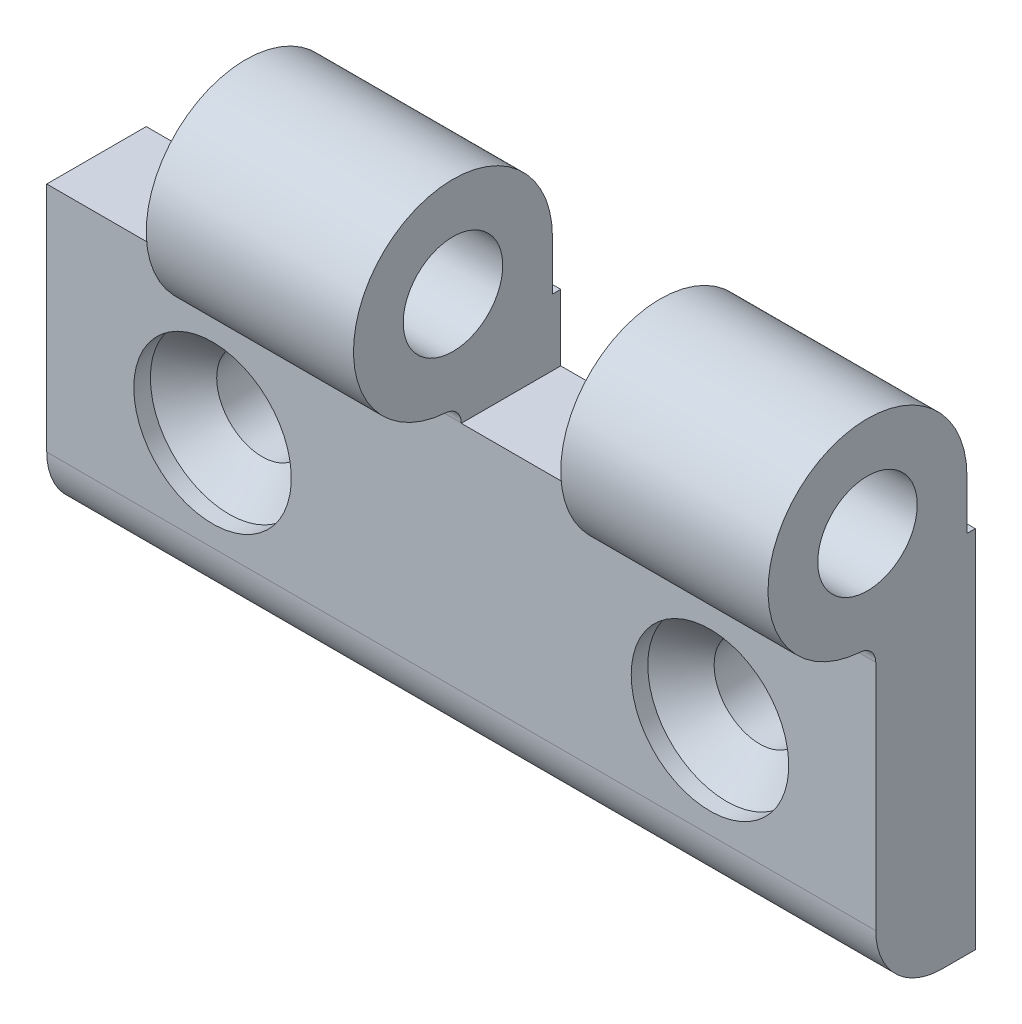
ISO-10303-21;
HEADER;
FILE_DESCRIPTION(('STEP AP214'),'2;1');
FILE_NAME('part.step','',(''),(''),'','','');
FILE_SCHEMA(('AUTOMOTIVE_DESIGN { 1 0 10303 214 1 1 1 1 }'));
ENDSEC;
DATA;
#1=APPLICATION_CONTEXT('core data for automotive mechanical design processes');
#2=APPLICATION_PROTOCOL_DEFINITION('international standard','automotive_design',2000,#1);
#3=PRODUCT_CONTEXT('',#1,'mechanical');
#4=PRODUCT('Part','Part','',(#3));
#5=PRODUCT_RELATED_PRODUCT_CATEGORY('part','',(#4));
#6=PRODUCT_DEFINITION_FORMATION('','',#4);
#7=PRODUCT_DEFINITION_CONTEXT('part definition',#1,'design');
#8=PRODUCT_DEFINITION('design','',#6,#7);
#9=PRODUCT_DEFINITION_SHAPE('','',#8);
#10=(LENGTH_UNIT() NAMED_UNIT(*) SI_UNIT(.MILLI.,.METRE.));
#11=(NAMED_UNIT(*) PLANE_ANGLE_UNIT() SI_UNIT($,.RADIAN.));
#12=(NAMED_UNIT(*) SI_UNIT($,.STERADIAN.) SOLID_ANGLE_UNIT());
#13=UNCERTAINTY_MEASURE_WITH_UNIT(LENGTH_MEASURE(1.E-05),#10,'distance_accuracy_value','');
#14=(GEOMETRIC_REPRESENTATION_CONTEXT(3) GLOBAL_UNCERTAINTY_ASSIGNED_CONTEXT((#13)) GLOBAL_UNIT_ASSIGNED_CONTEXT((#10,
#11,#12)) REPRESENTATION_CONTEXT('',''));
#15=CARTESIAN_POINT('',(0.,0.,0.));
#16=DIRECTION('',(0.,0.,1.));
#17=DIRECTION('',(1.,0.,0.));
#18=AXIS2_PLACEMENT_3D('',#15,#16,#17);
#19=CARTESIAN_POINT('',(30.,0.,5.5));
#20=DIRECTION('',(0.,0.,-1.));
#21=DIRECTION('',(-1.,0.,0.));
#22=AXIS2_PLACEMENT_3D('',#19,#20,#21);
#23=CYLINDRICAL_SURFACE('',#22,4.75);
#24=CARTESIAN_POINT('',(30.,0.,6.));
#25=DIRECTION('',(0.,0.,1.));
#26=DIRECTION('',(-1.,0.,0.));
#27=AXIS2_PLACEMENT_3D('',#24,#25,#26);
#28=CIRCLE('',#27,4.75);
#29=CARTESIAN_POINT('',(25.25,0.,6.));
#30=VERTEX_POINT('',#29);
#31=EDGE_CURVE('E153',#30,#30,#28,.T.);
#32=ORIENTED_EDGE('',*,*,#31,.T.);
#33=EDGE_LOOP('',(#32));
#34=FACE_BOUND('',#33,.T.);
#35=CARTESIAN_POINT('',(30.,0.,4.99999999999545));
#36=DIRECTION('',(0.,0.,-1.));
#37=DIRECTION('',(1.,0.,0.));
#38=AXIS2_PLACEMENT_3D('',#35,#36,#37);
#39=CIRCLE('',#38,4.74999999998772);
#40=CARTESIAN_POINT('',(34.7499999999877,0.,4.99999999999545));
#41=VERTEX_POINT('',#40);
#42=EDGE_CURVE('E256',#41,#41,#39,.F.);
#43=ORIENTED_EDGE('',*,*,#42,.F.);
#44=EDGE_LOOP('',(#43));
#45=FACE_BOUND('',#44,.T.);
#46=ADVANCED_FACE('F14',(#34,#45),#23,.F.);
#47=CARTESIAN_POINT('',(0.,0.,5.5));
#48=DIRECTION('',(0.,0.,-1.));
#49=DIRECTION('',(-1.,0.,0.));
#50=AXIS2_PLACEMENT_3D('',#47,#48,#49);
#51=CYLINDRICAL_SURFACE('',#50,4.75);
#52=CARTESIAN_POINT('',(0.,0.,6.));
#53=DIRECTION('',(0.,0.,1.));
#54=DIRECTION('',(-1.,0.,0.));
#55=AXIS2_PLACEMENT_3D('',#52,#53,#54);
#56=CIRCLE('',#55,4.75);
#57=CARTESIAN_POINT('',(-4.75,0.,6.));
#58=VERTEX_POINT('',#57);
#59=EDGE_CURVE('E157',#58,#58,#56,.T.);
#60=ORIENTED_EDGE('',*,*,#59,.T.);
#61=EDGE_LOOP('',(#60));
#62=FACE_BOUND('',#61,.T.);
#63=CARTESIAN_POINT('',(0.,0.,4.99999999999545));
#64=DIRECTION('',(0.,0.,-1.));
#65=DIRECTION('',(1.,0.,0.));
#66=AXIS2_PLACEMENT_3D('',#63,#64,#65);
#67=CIRCLE('',#66,4.74999999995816);
#68=CARTESIAN_POINT('',(4.74999999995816,0.,4.99999999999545));
#69=VERTEX_POINT('',#68);
#70=EDGE_CURVE('E225',#69,#69,#67,.F.);
#71=ORIENTED_EDGE('',*,*,#70,.F.);
#72=EDGE_LOOP('',(#71));
#73=FACE_BOUND('',#72,.T.);
#74=ADVANCED_FACE('F320',(#62,#73),#51,.F.);
#75=CARTESIAN_POINT('',(15.,8.01787997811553,7.));
#76=DIRECTION('',(1.,0.,0.));
#77=DIRECTION('',(0.,-1.,0.));
#78=AXIS2_PLACEMENT_3D('',#75,#76,#77);
#79=CYLINDRICAL_SURFACE('',#78,1.);
#80=DIRECTION('',(1.,0.,0.));
#81=VECTOR('',#80,1.);
#82=CARTESIAN_POINT('',(15.,9.0153256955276,6.92857142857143));
#83=LINE('',#82,#81);
#84=CARTESIAN_POINT('',(15.,9.0153256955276,6.92857142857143));
#85=VERTEX_POINT('',#84);
#86=CARTESIAN_POINT('',(2.5,9.0153256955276,6.92857142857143));
#87=VERTEX_POINT('',#86);
#88=EDGE_CURVE('E147',#85,#87,#83,.F.);
#89=ORIENTED_EDGE('',*,*,#88,.T.);
#90=CARTESIAN_POINT('',(2.5,8.01787997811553,7.));
#91=DIRECTION('',(-1.,0.,0.));
#92=DIRECTION('',(0.,-1.,0.));
#93=AXIS2_PLACEMENT_3D('',#90,#91,#92);
#94=CIRCLE('',#93,1.);
#95=CARTESIAN_POINT('',(2.5,8.01787997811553,6.));
#96=VERTEX_POINT('',#95);
#97=EDGE_CURVE('E149',#87,#96,#94,.T.);
#98=ORIENTED_EDGE('',*,*,#97,.T.);
#99=DIRECTION('',(1.,0.,0.));
#100=VECTOR('',#99,1.);
#101=CARTESIAN_POINT('',(-10.,8.01787997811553,6.));
#102=LINE('',#101,#100);
#103=CARTESIAN_POINT('',(15.,8.01787997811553,6.));
#104=VERTEX_POINT('',#103);
#105=EDGE_CURVE('E148',#96,#104,#102,.T.);
#106=ORIENTED_EDGE('',*,*,#105,.T.);
#107=CARTESIAN_POINT('',(15.,8.01787997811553,7.));
#108=DIRECTION('',(-1.,0.,0.));
#109=DIRECTION('',(0.,-1.,0.));
#110=AXIS2_PLACEMENT_3D('',#107,#108,#109);
#111=CIRCLE('',#110,1.);
#112=EDGE_CURVE('E17',#104,#85,#111,.F.);
#113=ORIENTED_EDGE('',*,*,#112,.T.);
#114=EDGE_LOOP('',(#89,#98,#106,#113));
#115=FACE_BOUND('',#114,.T.);
#116=ADVANCED_FACE('F145',(#115),#79,.F.);
#117=CARTESIAN_POINT('',(27.5,8.01787997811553,7.));
#118=DIRECTION('',(-1.,0.,0.));
#119=DIRECTION('',(0.,1.,0.));
#120=AXIS2_PLACEMENT_3D('',#117,#118,#119);
#121=CYLINDRICAL_SURFACE('',#120,1.);
#122=DIRECTION('',(1.,0.,0.));
#123=VECTOR('',#122,1.);
#124=CARTESIAN_POINT('',(-10.,8.01787997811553,6.));
#125=LINE('',#124,#123);
#126=CARTESIAN_POINT('',(27.5,8.01787997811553,6.));
#127=VERTEX_POINT('',#126);
#128=CARTESIAN_POINT('',(40.,8.01787997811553,6.));
#129=VERTEX_POINT('',#128);
#130=EDGE_CURVE('E216',#127,#129,#125,.T.);
#131=ORIENTED_EDGE('',*,*,#130,.T.);
#132=CARTESIAN_POINT('',(40.,8.01787997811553,7.));
#133=DIRECTION('',(1.,0.,0.));
#134=DIRECTION('',(0.,1.,0.));
#135=AXIS2_PLACEMENT_3D('',#132,#133,#134);
#136=CIRCLE('',#135,1.);
#137=CARTESIAN_POINT('',(40.,9.0153256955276,6.92857142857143));
#138=VERTEX_POINT('',#137);
#139=EDGE_CURVE('E259',#129,#138,#136,.T.);
#140=ORIENTED_EDGE('',*,*,#139,.T.);
#141=DIRECTION('',(-1.,0.,0.));
#142=VECTOR('',#141,1.);
#143=CARTESIAN_POINT('',(27.5,9.0153256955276,6.92857142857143));
#144=LINE('',#143,#142);
#145=CARTESIAN_POINT('',(27.5,9.0153256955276,6.92857142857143));
#146=VERTEX_POINT('',#145);
#147=EDGE_CURVE('E159',#138,#146,#144,.T.);
#148=ORIENTED_EDGE('',*,*,#147,.T.);
#149=CARTESIAN_POINT('',(27.5,8.01787997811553,7.));
#150=DIRECTION('',(1.,0.,0.));
#151=DIRECTION('',(0.,1.,0.));
#152=AXIS2_PLACEMENT_3D('',#149,#150,#151);
#153=CIRCLE('',#152,1.);
#154=EDGE_CURVE('E294',#146,#127,#153,.F.);
#155=ORIENTED_EDGE('',*,*,#154,.T.);
#156=EDGE_LOOP('',(#131,#140,#148,#155));
#157=FACE_BOUND('',#156,.T.);
#158=ADVANCED_FACE('F326',(#157),#121,.F.);
#159=CARTESIAN_POINT('',(30.,0.,4.99999999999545));
#160=DIRECTION('',(0.,0.,1.));
#161=DIRECTION('',(1.,0.,0.));
#162=AXIS2_PLACEMENT_3D('',#159,#160,#161);
#163=CONICAL_SURFACE('',#162,4.74999999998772,0.785398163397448);
#164=CARTESIAN_POINT('',(30.,0.,3.));
#165=DIRECTION('',(0.,0.,1.));
#166=DIRECTION('',(-1.,0.,0.));
#167=AXIS2_PLACEMENT_3D('',#164,#165,#166);
#168=CIRCLE('',#167,2.75);
#169=CARTESIAN_POINT('',(27.25,0.,3.));
#170=VERTEX_POINT('',#169);
#171=EDGE_CURVE('E251',#170,#170,#168,.T.);
#172=ORIENTED_EDGE('',*,*,#171,.F.);
#173=EDGE_LOOP('',(#172));
#174=FACE_BOUND('',#173,.T.);
#175=ORIENTED_EDGE('',*,*,#42,.T.);
#176=EDGE_LOOP('',(#175));
#177=FACE_BOUND('',#176,.T.);
#178=ADVANCED_FACE('F323',(#174,#177),#163,.F.);
#179=CARTESIAN_POINT('',(0.,0.,4.99999999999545));
#180=DIRECTION('',(0.,0.,1.));
#181=DIRECTION('',(1.,0.,0.));
#182=AXIS2_PLACEMENT_3D('',#179,#180,#181);
#183=CONICAL_SURFACE('',#182,4.74999999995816,0.785398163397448);
#184=CARTESIAN_POINT('',(0.,0.,3.));
#185=DIRECTION('',(0.,0.,1.));
#186=DIRECTION('',(-1.,0.,0.));
#187=AXIS2_PLACEMENT_3D('',#184,#185,#186);
#188=CIRCLE('',#187,2.75);
#189=CARTESIAN_POINT('',(-2.75,0.,3.));
#190=VERTEX_POINT('',#189);
#191=EDGE_CURVE('E247',#190,#190,#188,.T.);
#192=ORIENTED_EDGE('',*,*,#191,.F.);
#193=EDGE_LOOP('',(#192));
#194=FACE_BOUND('',#193,.T.);
#195=ORIENTED_EDGE('',*,*,#70,.T.);
#196=EDGE_LOOP('',(#195));
#197=FACE_BOUND('',#196,.T.);
#198=ADVANCED_FACE('F325',(#194,#197),#183,.F.);
#199=CARTESIAN_POINT('',(27.5,15.,6.5));
#200=DIRECTION('',(-1.,0.,0.));
#201=DIRECTION('',(0.,1.,0.));
#202=AXIS2_PLACEMENT_3D('',#199,#200,#201);
#203=CYLINDRICAL_SURFACE('',#202,3.);
#204=CARTESIAN_POINT('',(40.,15.,6.5));
#205=DIRECTION('',(1.,0.,0.));
#206=DIRECTION('',(0.,1.,0.));
#207=AXIS2_PLACEMENT_3D('',#204,#205,#206);
#208=CIRCLE('',#207,3.);
#209=CARTESIAN_POINT('',(40.,18.,6.5));
#210=VERTEX_POINT('',#209);
#211=EDGE_CURVE('E250',#210,#210,#208,.F.);
#212=ORIENTED_EDGE('',*,*,#211,.F.);
#213=EDGE_LOOP('',(#212));
#214=FACE_BOUND('',#213,.T.);
#215=CARTESIAN_POINT('',(27.5,15.,6.5));
#216=DIRECTION('',(1.,0.,0.));
#217=DIRECTION('',(0.,1.,0.));
#218=AXIS2_PLACEMENT_3D('',#215,#216,#217);
#219=CIRCLE('',#218,3.);
#220=CARTESIAN_POINT('',(27.5,18.,6.5));
#221=VERTEX_POINT('',#220);
#222=EDGE_CURVE('E229',#221,#221,#219,.F.);
#223=ORIENTED_EDGE('',*,*,#222,.T.);
#224=EDGE_LOOP('',(#223));
#225=FACE_BOUND('',#224,.T.);
#226=ADVANCED_FACE('F335',(#214,#225),#203,.F.);
#227=CARTESIAN_POINT('',(27.5,12.,0.5));
#228=DIRECTION('',(0.,0.,-1.));
#229=DIRECTION('',(-1.,0.,0.));
#230=AXIS2_PLACEMENT_3D('',#227,#228,#229);
#231=PLANE('',#230);
#232=DIRECTION('',(0.,1.,0.));
#233=VECTOR('',#232,1.);
#234=CARTESIAN_POINT('',(27.5,15.,0.5));
#235=LINE('',#234,#233);
#236=CARTESIAN_POINT('',(27.5,12.,0.5));
#237=VERTEX_POINT('',#236);
#238=CARTESIAN_POINT('',(27.5,15.,0.5));
#239=VERTEX_POINT('',#238);
#240=EDGE_CURVE('E228',#237,#239,#235,.T.);
#241=ORIENTED_EDGE('',*,*,#240,.T.);
#242=DIRECTION('',(-1.,0.,0.));
#243=VECTOR('',#242,1.);
#244=CARTESIAN_POINT('',(27.5,15.,0.5));
#245=LINE('',#244,#243);
#246=CARTESIAN_POINT('',(40.,15.,0.5));
#247=VERTEX_POINT('',#246);
#248=EDGE_CURVE('E222',#239,#247,#245,.F.);
#249=ORIENTED_EDGE('',*,*,#248,.T.);
#250=DIRECTION('',(0.,1.,0.));
#251=VECTOR('',#250,1.);
#252=CARTESIAN_POINT('',(40.,15.,0.5));
#253=LINE('',#252,#251);
#254=CARTESIAN_POINT('',(40.,12.,0.5));
#255=VERTEX_POINT('',#254);
#256=EDGE_CURVE('E287',#255,#247,#253,.T.);
#257=ORIENTED_EDGE('',*,*,#256,.F.);
#258=DIRECTION('',(1.,0.,0.));
#259=VECTOR('',#258,1.);
#260=CARTESIAN_POINT('',(27.5,12.,0.5));
#261=LINE('',#260,#259);
#262=EDGE_CURVE('E232',#255,#237,#261,.F.);
#263=ORIENTED_EDGE('',*,*,#262,.T.);
#264=EDGE_LOOP('',(#241,#249,#257,#263));
#265=FACE_BOUND('',#264,.T.);
#266=ADVANCED_FACE('F550',(#265),#231,.T.);
#267=CARTESIAN_POINT('',(27.5,15.,6.5));
#268=DIRECTION('',(-1.,0.,0.));
#269=DIRECTION('',(0.,1.,0.));
#270=AXIS2_PLACEMENT_3D('',#267,#268,#269);
#271=CYLINDRICAL_SURFACE('',#270,6.);
#272=ORIENTED_EDGE('',*,*,#147,.F.);
#273=CARTESIAN_POINT('',(40.,15.,6.5));
#274=DIRECTION('',(1.,0.,0.));
#275=DIRECTION('',(0.,1.,0.));
#276=AXIS2_PLACEMENT_3D('',#273,#274,#275);
#277=CIRCLE('',#276,6.);
#278=EDGE_CURVE('E285',#247,#138,#277,.T.);
#279=ORIENTED_EDGE('',*,*,#278,.F.);
#280=ORIENTED_EDGE('',*,*,#248,.F.);
#281=CARTESIAN_POINT('',(27.5,15.,6.5));
#282=DIRECTION('',(1.,0.,0.));
#283=DIRECTION('',(0.,1.,0.));
#284=AXIS2_PLACEMENT_3D('',#281,#282,#283);
#285=CIRCLE('',#284,6.);
#286=EDGE_CURVE('E278',#239,#146,#285,.T.);
#287=ORIENTED_EDGE('',*,*,#286,.T.);
#288=EDGE_LOOP('',(#272,#279,#280,#287));
#289=FACE_BOUND('',#288,.T.);
#290=ADVANCED_FACE('F546',(#289),#271,.T.);
#291=CARTESIAN_POINT('',(15.,15.,6.5));
#292=DIRECTION('',(1.,0.,0.));
#293=DIRECTION('',(0.,-1.,0.));
#294=AXIS2_PLACEMENT_3D('',#291,#292,#293);
#295=CYLINDRICAL_SURFACE('',#294,3.);
#296=CARTESIAN_POINT('',(15.,15.,6.5));
#297=DIRECTION('',(-1.,0.,0.));
#298=DIRECTION('',(0.,-1.,0.));
#299=AXIS2_PLACEMENT_3D('',#296,#297,#298);
#300=CIRCLE('',#299,3.);
#301=CARTESIAN_POINT('',(15.,12.,6.5));
#302=VERTEX_POINT('',#301);
#303=EDGE_CURVE('E184',#302,#302,#300,.T.);
#304=ORIENTED_EDGE('',*,*,#303,.F.);
#305=EDGE_LOOP('',(#304));
#306=FACE_BOUND('',#305,.T.);
#307=CARTESIAN_POINT('',(2.5,15.,6.5));
#308=DIRECTION('',(-1.,0.,0.));
#309=DIRECTION('',(0.,-1.,0.));
#310=AXIS2_PLACEMENT_3D('',#307,#308,#309);
#311=CIRCLE('',#310,3.);
#312=CARTESIAN_POINT('',(2.5,12.,6.5));
#313=VERTEX_POINT('',#312);
#314=EDGE_CURVE('E167',#313,#313,#311,.T.);
#315=ORIENTED_EDGE('',*,*,#314,.T.);
#316=EDGE_LOOP('',(#315));
#317=FACE_BOUND('',#316,.T.);
#318=ADVANCED_FACE('F542',(#306,#317),#295,.F.);
#319=CARTESIAN_POINT('',(15.,15.,0.5));
#320=DIRECTION('',(0.,0.,-1.));
#321=DIRECTION('',(-1.,0.,0.));
#322=AXIS2_PLACEMENT_3D('',#319,#320,#321);
#323=PLANE('',#322);
#324=DIRECTION('',(0.,1.,0.));
#325=VECTOR('',#324,1.);
#326=CARTESIAN_POINT('',(15.,15.,0.5));
#327=LINE('',#326,#325);
#328=CARTESIAN_POINT('',(15.,12.,0.5));
#329=VERTEX_POINT('',#328);
#330=CARTESIAN_POINT('',(15.,15.,0.5));
#331=VERTEX_POINT('',#330);
#332=EDGE_CURVE('E137',#329,#331,#327,.T.);
#333=ORIENTED_EDGE('',*,*,#332,.F.);
#334=DIRECTION('',(1.,0.,0.));
#335=VECTOR('',#334,1.);
#336=CARTESIAN_POINT('',(15.,12.,0.5));
#337=LINE('',#336,#335);
#338=CARTESIAN_POINT('',(2.5,12.,0.5));
#339=VERTEX_POINT('',#338);
#340=EDGE_CURVE('E170',#329,#339,#337,.F.);
#341=ORIENTED_EDGE('',*,*,#340,.T.);
#342=DIRECTION('',(0.,1.,0.));
#343=VECTOR('',#342,1.);
#344=CARTESIAN_POINT('',(2.5,15.,0.5));
#345=LINE('',#344,#343);
#346=CARTESIAN_POINT('',(2.5,15.,0.5));
#347=VERTEX_POINT('',#346);
#348=EDGE_CURVE('E166',#339,#347,#345,.T.);
#349=ORIENTED_EDGE('',*,*,#348,.T.);
#350=DIRECTION('',(1.,0.,0.));
#351=VECTOR('',#350,1.);
#352=CARTESIAN_POINT('',(15.,15.,0.5));
#353=LINE('',#352,#351);
#354=EDGE_CURVE('E154',#347,#331,#353,.T.);
#355=ORIENTED_EDGE('',*,*,#354,.T.);
#356=EDGE_LOOP('',(#333,#341,#349,#355));
#357=FACE_BOUND('',#356,.T.);
#358=ADVANCED_FACE('F540',(#357),#323,.T.);
#359=CARTESIAN_POINT('',(15.,15.,6.5));
#360=DIRECTION('',(1.,0.,0.));
#361=DIRECTION('',(0.,-1.,0.));
#362=AXIS2_PLACEMENT_3D('',#359,#360,#361);
#363=CYLINDRICAL_SURFACE('',#362,6.);
#364=ORIENTED_EDGE('',*,*,#88,.F.);
#365=CARTESIAN_POINT('',(15.,15.,6.5));
#366=DIRECTION('',(-1.,0.,0.));
#367=DIRECTION('',(0.,-1.,0.));
#368=AXIS2_PLACEMENT_3D('',#365,#366,#367);
#369=CIRCLE('',#368,6.);
#370=EDGE_CURVE('E132',#331,#85,#369,.F.);
#371=ORIENTED_EDGE('',*,*,#370,.F.);
#372=ORIENTED_EDGE('',*,*,#354,.F.);
#373=CARTESIAN_POINT('',(2.5,15.,6.5));
#374=DIRECTION('',(-1.,0.,0.));
#375=DIRECTION('',(0.,-1.,0.));
#376=AXIS2_PLACEMENT_3D('',#373,#374,#375);
#377=CIRCLE('',#376,6.);
#378=EDGE_CURVE('E151',#347,#87,#377,.F.);
#379=ORIENTED_EDGE('',*,*,#378,.T.);
#380=EDGE_LOOP('',(#364,#371,#372,#379));
#381=FACE_BOUND('',#380,.T.);
#382=ADVANCED_FACE('F150',(#381),#363,.T.);
#383=CARTESIAN_POINT('',(-10.,8.,6.));
#384=DIRECTION('',(0.,0.,1.));
#385=DIRECTION('',(1.,0.,0.));
#386=AXIS2_PLACEMENT_3D('',#383,#384,#385);
#387=PLANE('',#386);
#388=DIRECTION('',(0.,1.,0.));
#389=VECTOR('',#388,1.);
#390=CARTESIAN_POINT('',(27.5,15.,6.));
#391=LINE('',#390,#389);
#392=CARTESIAN_POINT('',(27.5,8.,6.));
#393=VERTEX_POINT('',#392);
#394=EDGE_CURVE('E203',#127,#393,#391,.F.);
#395=ORIENTED_EDGE('',*,*,#394,.T.);
#396=DIRECTION('',(1.,0.,0.));
#397=VECTOR('',#396,1.);
#398=CARTESIAN_POINT('',(-10.,8.,6.));
#399=LINE('',#398,#397);
#400=CARTESIAN_POINT('',(15.,8.,6.));
#401=VERTEX_POINT('',#400);
#402=EDGE_CURVE('E192',#393,#401,#399,.F.);
#403=ORIENTED_EDGE('',*,*,#402,.T.);
#404=DIRECTION('',(0.,1.,0.));
#405=VECTOR('',#404,1.);
#406=CARTESIAN_POINT('',(15.,15.,6.));
#407=LINE('',#406,#405);
#408=EDGE_CURVE('E127',#104,#401,#407,.F.);
#409=ORIENTED_EDGE('',*,*,#408,.F.);
#410=ORIENTED_EDGE('',*,*,#105,.F.);
#411=DIRECTION('',(0.,1.,0.));
#412=VECTOR('',#411,1.);
#413=CARTESIAN_POINT('',(2.5,15.,6.));
#414=LINE('',#413,#412);
#415=CARTESIAN_POINT('',(2.5,8.,6.));
#416=VERTEX_POINT('',#415);
#417=EDGE_CURVE('E273',#96,#416,#414,.F.);
#418=ORIENTED_EDGE('',*,*,#417,.T.);
#419=DIRECTION('',(1.,0.,0.));
#420=VECTOR('',#419,1.);
#421=CARTESIAN_POINT('',(-10.,8.,6.));
#422=LINE('',#421,#420);
#423=CARTESIAN_POINT('',(-10.,8.,6.));
#424=VERTEX_POINT('',#423);
#425=EDGE_CURVE('E634',#416,#424,#422,.F.);
#426=ORIENTED_EDGE('',*,*,#425,.T.);
#427=DIRECTION('',(0.,1.,0.));
#428=VECTOR('',#427,1.);
#429=CARTESIAN_POINT('',(-10.,15.,6.));
#430=LINE('',#429,#428);
#431=CARTESIAN_POINT('',(-10.,-6.,6.));
#432=VERTEX_POINT('',#431);
#433=EDGE_CURVE('E271',#424,#432,#430,.F.);
#434=ORIENTED_EDGE('',*,*,#433,.T.);
#435=DIRECTION('',(-1.,0.,0.));
#436=VECTOR('',#435,1.);
#437=CARTESIAN_POINT('',(-10.,-6.,6.));
#438=LINE('',#437,#436);
#439=CARTESIAN_POINT('',(40.,-6.,6.));
#440=VERTEX_POINT('',#439);
#441=EDGE_CURVE('E219',#432,#440,#438,.F.);
#442=ORIENTED_EDGE('',*,*,#441,.T.);
#443=DIRECTION('',(0.,1.,0.));
#444=VECTOR('',#443,1.);
#445=CARTESIAN_POINT('',(40.,15.,6.));
#446=LINE('',#445,#444);
#447=EDGE_CURVE('E284',#129,#440,#446,.F.);
#448=ORIENTED_EDGE('',*,*,#447,.F.);
#449=ORIENTED_EDGE('',*,*,#130,.F.);
#450=EDGE_LOOP('',(#395,#403,#409,#410,#418,#426,#434,#442,#448,#449));
#451=FACE_BOUND('',#450,.T.);
#452=ORIENTED_EDGE('',*,*,#59,.F.);
#453=EDGE_LOOP('',(#452));
#454=FACE_BOUND('',#453,.T.);
#455=ORIENTED_EDGE('',*,*,#31,.F.);
#456=EDGE_LOOP('',(#455));
#457=FACE_BOUND('',#456,.T.);
#458=ADVANCED_FACE('F308',(#451,#454,#457),#387,.T.);
#459=CARTESIAN_POINT('',(-10.,-6.,2.));
#460=DIRECTION('',(-1.,0.,0.));
#461=DIRECTION('',(0.,1.,0.));
#462=AXIS2_PLACEMENT_3D('',#459,#460,#461);
#463=CYLINDRICAL_SURFACE('',#462,4.);
#464=CARTESIAN_POINT('',(-10.,-6.,2.));
#465=DIRECTION('',(1.,0.,0.));
#466=DIRECTION('',(0.,1.,0.));
#467=AXIS2_PLACEMENT_3D('',#464,#465,#466);
#468=CIRCLE('',#467,4.);
#469=CARTESIAN_POINT('',(-10.,-10.,2.));
#470=VERTEX_POINT('',#469);
#471=EDGE_CURVE('E267',#432,#470,#468,.T.);
#472=ORIENTED_EDGE('',*,*,#471,.T.);
#473=DIRECTION('',(-1.,0.,0.));
#474=VECTOR('',#473,1.);
#475=CARTESIAN_POINT('',(-10.,-10.,2.));
#476=LINE('',#475,#474);
#477=CARTESIAN_POINT('',(40.,-10.,2.));
#478=VERTEX_POINT('',#477);
#479=EDGE_CURVE('E266',#470,#478,#476,.F.);
#480=ORIENTED_EDGE('',*,*,#479,.T.);
#481=CARTESIAN_POINT('',(40.,-6.,2.));
#482=DIRECTION('',(1.,0.,0.));
#483=DIRECTION('',(0.,1.,0.));
#484=AXIS2_PLACEMENT_3D('',#481,#482,#483);
#485=CIRCLE('',#484,4.);
#486=EDGE_CURVE('E244',#440,#478,#485,.T.);
#487=ORIENTED_EDGE('',*,*,#486,.F.);
#488=ORIENTED_EDGE('',*,*,#441,.F.);
#489=EDGE_LOOP('',(#472,#480,#487,#488));
#490=FACE_BOUND('',#489,.T.);
#491=ADVANCED_FACE('F312',(#490),#463,.T.);
#492=CARTESIAN_POINT('',(30.,0.,1.5));
#493=DIRECTION('',(0.,0.,-1.));
#494=DIRECTION('',(-1.,0.,0.));
#495=AXIS2_PLACEMENT_3D('',#492,#493,#494);
#496=CYLINDRICAL_SURFACE('',#495,2.75);
#497=CARTESIAN_POINT('',(30.,0.,0.));
#498=DIRECTION('',(0.,0.,1.));
#499=DIRECTION('',(-1.,0.,0.));
#500=AXIS2_PLACEMENT_3D('',#497,#498,#499);
#501=CIRCLE('',#500,2.75);
#502=CARTESIAN_POINT('',(27.25,0.,0.));
#503=VERTEX_POINT('',#502);
#504=EDGE_CURVE('E263',#503,#503,#501,.F.);
#505=ORIENTED_EDGE('',*,*,#504,.T.);
#506=EDGE_LOOP('',(#505));
#507=FACE_BOUND('',#506,.T.);
#508=ORIENTED_EDGE('',*,*,#171,.T.);
#509=EDGE_LOOP('',(#508));
#510=FACE_BOUND('',#509,.T.);
#511=ADVANCED_FACE('F407',(#507,#510),#496,.F.);
#512=CARTESIAN_POINT('',(0.,0.,1.5));
#513=DIRECTION('',(0.,0.,-1.));
#514=DIRECTION('',(-1.,0.,0.));
#515=AXIS2_PLACEMENT_3D('',#512,#513,#514);
#516=CYLINDRICAL_SURFACE('',#515,2.75);
#517=CARTESIAN_POINT('',(0.,0.,0.));
#518=DIRECTION('',(0.,0.,1.));
#519=DIRECTION('',(-1.,0.,0.));
#520=AXIS2_PLACEMENT_3D('',#517,#518,#519);
#521=CIRCLE('',#520,2.75);
#522=CARTESIAN_POINT('',(-2.75,0.,0.));
#523=VERTEX_POINT('',#522);
#524=EDGE_CURVE('E260',#523,#523,#521,.F.);
#525=ORIENTED_EDGE('',*,*,#524,.T.);
#526=EDGE_LOOP('',(#525));
#527=FACE_BOUND('',#526,.T.);
#528=ORIENTED_EDGE('',*,*,#191,.T.);
#529=EDGE_LOOP('',(#528));
#530=FACE_BOUND('',#529,.T.);
#531=ADVANCED_FACE('F415',(#527,#530),#516,.F.);
#532=CARTESIAN_POINT('',(40.,15.,0.));
#533=DIRECTION('',(-1.,0.,0.));
#534=DIRECTION('',(0.,1.,0.));
#535=AXIS2_PLACEMENT_3D('',#532,#533,#534);
#536=PLANE('',#535);
#537=DIRECTION('',(0.,0.,1.));
#538=VECTOR('',#537,1.);
#539=CARTESIAN_POINT('',(40.,-10.,2.));
#540=LINE('',#539,#538);
#541=CARTESIAN_POINT('',(40.,-10.,0.));
#542=VERTEX_POINT('',#541);
#543=EDGE_CURVE('E270',#478,#542,#540,.F.);
#544=ORIENTED_EDGE('',*,*,#543,.T.);
#545=DIRECTION('',(0.,-1.,0.));
#546=VECTOR('',#545,1.);
#547=CARTESIAN_POINT('',(40.,-10.,0.));
#548=LINE('',#547,#546);
#549=CARTESIAN_POINT('',(40.,12.,0.));
#550=VERTEX_POINT('',#549);
#551=EDGE_CURVE('E240',#542,#550,#548,.F.);
#552=ORIENTED_EDGE('',*,*,#551,.T.);
#553=DIRECTION('',(0.,0.,1.));
#554=VECTOR('',#553,1.);
#555=CARTESIAN_POINT('',(40.,12.,0.));
#556=LINE('',#555,#554);
#557=EDGE_CURVE('E235',#550,#255,#556,.T.);
#558=ORIENTED_EDGE('',*,*,#557,.T.);
#559=ORIENTED_EDGE('',*,*,#256,.T.);
#560=ORIENTED_EDGE('',*,*,#278,.T.);
#561=ORIENTED_EDGE('',*,*,#139,.F.);
#562=ORIENTED_EDGE('',*,*,#447,.T.);
#563=ORIENTED_EDGE('',*,*,#486,.T.);
#564=EDGE_LOOP('',(#544,#552,#558,#559,#560,#561,#562,#563));
#565=FACE_BOUND('',#564,.T.);
#566=ORIENTED_EDGE('',*,*,#211,.T.);
#567=EDGE_LOOP('',(#566));
#568=FACE_BOUND('',#567,.T.);
#569=ADVANCED_FACE('F424',(#565,#568),#536,.F.);
#570=CARTESIAN_POINT('',(27.5,12.,0.));
#571=DIRECTION('',(0.,1.,0.));
#572=DIRECTION('',(1.,0.,0.));
#573=AXIS2_PLACEMENT_3D('',#570,#571,#572);
#574=PLANE('',#573);
#575=DIRECTION('',(0.,0.,1.));
#576=VECTOR('',#575,1.);
#577=CARTESIAN_POINT('',(27.5,12.,0.));
#578=LINE('',#577,#576);
#579=CARTESIAN_POINT('',(27.5,12.,0.));
#580=VERTEX_POINT('',#579);
#581=EDGE_CURVE('E226',#580,#237,#578,.T.);
#582=ORIENTED_EDGE('',*,*,#581,.T.);
#583=ORIENTED_EDGE('',*,*,#262,.F.);
#584=ORIENTED_EDGE('',*,*,#557,.F.);
#585=DIRECTION('',(-1.,0.,0.));
#586=VECTOR('',#585,1.);
#587=CARTESIAN_POINT('',(-10.,12.,0.));
#588=LINE('',#587,#586);
#589=EDGE_CURVE('E213',#550,#580,#588,.T.);
#590=ORIENTED_EDGE('',*,*,#589,.T.);
#591=EDGE_LOOP('',(#582,#583,#584,#590));
#592=FACE_BOUND('',#591,.T.);
#593=ADVANCED_FACE('F433',(#592),#574,.T.);
#594=CARTESIAN_POINT('',(27.5,15.,0.));
#595=DIRECTION('',(-1.,0.,0.));
#596=DIRECTION('',(0.,1.,0.));
#597=AXIS2_PLACEMENT_3D('',#594,#595,#596);
#598=PLANE('',#597);
#599=ORIENTED_EDGE('',*,*,#154,.F.);
#600=ORIENTED_EDGE('',*,*,#286,.F.);
#601=ORIENTED_EDGE('',*,*,#240,.F.);
#602=ORIENTED_EDGE('',*,*,#581,.F.);
#603=DIRECTION('',(0.,-1.,0.));
#604=VECTOR('',#603,1.);
#605=CARTESIAN_POINT('',(27.5,-10.,0.));
#606=LINE('',#605,#604);
#607=CARTESIAN_POINT('',(27.5,8.,0.));
#608=VERTEX_POINT('',#607);
#609=EDGE_CURVE('E208',#580,#608,#606,.T.);
#610=ORIENTED_EDGE('',*,*,#609,.T.);
#611=DIRECTION('',(0.,0.,1.));
#612=VECTOR('',#611,1.);
#613=CARTESIAN_POINT('',(27.5,8.,0.));
#614=LINE('',#613,#612);
#615=EDGE_CURVE('E194',#608,#393,#614,.T.);
#616=ORIENTED_EDGE('',*,*,#615,.T.);
#617=ORIENTED_EDGE('',*,*,#394,.F.);
#618=EDGE_LOOP('',(#599,#600,#601,#602,#610,#616,#617));
#619=FACE_BOUND('',#618,.T.);
#620=ORIENTED_EDGE('',*,*,#222,.F.);
#621=EDGE_LOOP('',(#620));
#622=FACE_BOUND('',#621,.T.);
#623=ADVANCED_FACE('F442',(#619,#622),#598,.T.);
#624=CARTESIAN_POINT('',(-10.,8.,0.));
#625=DIRECTION('',(0.,1.,0.));
#626=DIRECTION('',(1.,0.,0.));
#627=AXIS2_PLACEMENT_3D('',#624,#625,#626);
#628=PLANE('',#627);
#629=DIRECTION('',(0.,0.,1.));
#630=VECTOR('',#629,1.);
#631=CARTESIAN_POINT('',(15.,8.,0.));
#632=LINE('',#631,#630);
#633=CARTESIAN_POINT('',(15.,8.,0.));
#634=VERTEX_POINT('',#633);
#635=EDGE_CURVE('E197',#401,#634,#632,.F.);
#636=ORIENTED_EDGE('',*,*,#635,.F.);
#637=ORIENTED_EDGE('',*,*,#402,.F.);
#638=ORIENTED_EDGE('',*,*,#615,.F.);
#639=DIRECTION('',(-1.,0.,0.));
#640=VECTOR('',#639,1.);
#641=CARTESIAN_POINT('',(-10.,8.,0.));
#642=LINE('',#641,#640);
#643=EDGE_CURVE('E189',#608,#634,#642,.T.);
#644=ORIENTED_EDGE('',*,*,#643,.T.);
#645=EDGE_LOOP('',(#636,#637,#638,#644));
#646=FACE_BOUND('',#645,.T.);
#647=ADVANCED_FACE('F451',(#646),#628,.T.);
#648=CARTESIAN_POINT('',(15.,15.,0.));
#649=DIRECTION('',(-1.,0.,0.));
#650=DIRECTION('',(0.,1.,0.));
#651=AXIS2_PLACEMENT_3D('',#648,#649,#650);
#652=PLANE('',#651);
#653=ORIENTED_EDGE('',*,*,#303,.T.);
#654=EDGE_LOOP('',(#653));
#655=FACE_BOUND('',#654,.T.);
#656=ORIENTED_EDGE('',*,*,#408,.T.);
#657=ORIENTED_EDGE('',*,*,#635,.T.);
#658=DIRECTION('',(0.,-1.,0.));
#659=VECTOR('',#658,1.);
#660=CARTESIAN_POINT('',(15.,-10.,0.));
#661=LINE('',#660,#659);
#662=CARTESIAN_POINT('',(15.,12.,0.));
#663=VERTEX_POINT('',#662);
#664=EDGE_CURVE('E180',#634,#663,#661,.F.);
#665=ORIENTED_EDGE('',*,*,#664,.T.);
#666=DIRECTION('',(0.,0.,1.));
#667=VECTOR('',#666,1.);
#668=CARTESIAN_POINT('',(15.,12.,0.5));
#669=LINE('',#668,#667);
#670=EDGE_CURVE('E173',#663,#329,#669,.T.);
#671=ORIENTED_EDGE('',*,*,#670,.T.);
#672=ORIENTED_EDGE('',*,*,#332,.T.);
#673=ORIENTED_EDGE('',*,*,#370,.T.);
#674=ORIENTED_EDGE('',*,*,#112,.F.);
#675=EDGE_LOOP('',(#656,#657,#665,#671,#672,#673,#674));
#676=FACE_BOUND('',#675,.T.);
#677=ADVANCED_FACE('F134',(#655,#676),#652,.F.);
#678=CARTESIAN_POINT('',(15.,12.,0.5));
#679=DIRECTION('',(0.,1.,0.));
#680=DIRECTION('',(1.,0.,0.));
#681=AXIS2_PLACEMENT_3D('',#678,#679,#680);
#682=PLANE('',#681);
#683=ORIENTED_EDGE('',*,*,#670,.F.);
#684=DIRECTION('',(-1.,0.,0.));
#685=VECTOR('',#684,1.);
#686=CARTESIAN_POINT('',(-10.,12.,0.));
#687=LINE('',#686,#685);
#688=CARTESIAN_POINT('',(2.5,12.,0.));
#689=VERTEX_POINT('',#688);
#690=EDGE_CURVE('E176',#663,#689,#687,.T.);
#691=ORIENTED_EDGE('',*,*,#690,.T.);
#692=DIRECTION('',(0.,0.,1.));
#693=VECTOR('',#692,1.);
#694=CARTESIAN_POINT('',(2.5,12.,0.));
#695=LINE('',#694,#693);
#696=EDGE_CURVE('E164',#689,#339,#695,.T.);
#697=ORIENTED_EDGE('',*,*,#696,.T.);
#698=ORIENTED_EDGE('',*,*,#340,.F.);
#699=EDGE_LOOP('',(#683,#691,#697,#698));
#700=FACE_BOUND('',#699,.T.);
#701=ADVANCED_FACE('F468',(#700),#682,.T.);
#702=CARTESIAN_POINT('',(2.5,15.,0.));
#703=DIRECTION('',(-1.,0.,0.));
#704=DIRECTION('',(0.,1.,0.));
#705=AXIS2_PLACEMENT_3D('',#702,#703,#704);
#706=PLANE('',#705);
#707=ORIENTED_EDGE('',*,*,#97,.F.);
#708=ORIENTED_EDGE('',*,*,#378,.F.);
#709=ORIENTED_EDGE('',*,*,#348,.F.);
#710=ORIENTED_EDGE('',*,*,#696,.F.);
#711=DIRECTION('',(0.,-1.,0.));
#712=VECTOR('',#711,1.);
#713=CARTESIAN_POINT('',(2.5,-10.,0.));
#714=LINE('',#713,#712);
#715=CARTESIAN_POINT('',(2.5,8.,0.));
#716=VERTEX_POINT('',#715);
#717=EDGE_CURVE('E179',#689,#716,#714,.T.);
#718=ORIENTED_EDGE('',*,*,#717,.T.);
#719=DIRECTION('',(0.,0.,1.));
#720=VECTOR('',#719,1.);
#721=CARTESIAN_POINT('',(2.5,8.,0.));
#722=LINE('',#721,#720);
#723=EDGE_CURVE('E303',#716,#416,#722,.T.);
#724=ORIENTED_EDGE('',*,*,#723,.T.);
#725=ORIENTED_EDGE('',*,*,#417,.F.);
#726=EDGE_LOOP('',(#707,#708,#709,#710,#718,#724,#725));
#727=FACE_BOUND('',#726,.T.);
#728=ORIENTED_EDGE('',*,*,#314,.F.);
#729=EDGE_LOOP('',(#728));
#730=FACE_BOUND('',#729,.T.);
#731=ADVANCED_FACE('F297',(#727,#730),#706,.T.);
#732=CARTESIAN_POINT('',(-10.,8.,0.));
#733=DIRECTION('',(0.,1.,0.));
#734=DIRECTION('',(1.,0.,0.));
#735=AXIS2_PLACEMENT_3D('',#732,#733,#734);
#736=PLANE('',#735);
#737=DIRECTION('',(0.,0.,1.));
#738=VECTOR('',#737,1.);
#739=CARTESIAN_POINT('',(-10.,8.,0.));
#740=LINE('',#739,#738);
#741=CARTESIAN_POINT('',(-10.,8.,0.));
#742=VERTEX_POINT('',#741);
#743=EDGE_CURVE('E632',#742,#424,#740,.T.);
#744=ORIENTED_EDGE('',*,*,#743,.T.);
#745=ORIENTED_EDGE('',*,*,#425,.F.);
#746=ORIENTED_EDGE('',*,*,#723,.F.);
#747=DIRECTION('',(-1.,0.,0.));
#748=VECTOR('',#747,1.);
#749=CARTESIAN_POINT('',(-10.,8.,0.));
#750=LINE('',#749,#748);
#751=EDGE_CURVE('E619',#716,#742,#750,.T.);
#752=ORIENTED_EDGE('',*,*,#751,.T.);
#753=EDGE_LOOP('',(#744,#745,#746,#752));
#754=FACE_BOUND('',#753,.T.);
#755=ADVANCED_FACE('F485',(#754),#736,.T.);
#756=CARTESIAN_POINT('',(-10.,15.,0.));
#757=DIRECTION('',(-1.,0.,0.));
#758=DIRECTION('',(0.,1.,0.));
#759=AXIS2_PLACEMENT_3D('',#756,#757,#758);
#760=PLANE('',#759);
#761=ORIENTED_EDGE('',*,*,#471,.F.);
#762=ORIENTED_EDGE('',*,*,#433,.F.);
#763=ORIENTED_EDGE('',*,*,#743,.F.);
#764=DIRECTION('',(0.,-1.,0.));
#765=VECTOR('',#764,1.);
#766=CARTESIAN_POINT('',(-10.,-10.,0.));
#767=LINE('',#766,#765);
#768=CARTESIAN_POINT('',(-10.,-10.,0.));
#769=VERTEX_POINT('',#768);
#770=EDGE_CURVE('E23',#742,#769,#767,.T.);
#771=ORIENTED_EDGE('',*,*,#770,.T.);
#772=DIRECTION('',(0.,0.,1.));
#773=VECTOR('',#772,1.);
#774=CARTESIAN_POINT('',(-10.,-10.,2.));
#775=LINE('',#774,#773);
#776=EDGE_CURVE('E611',#769,#470,#775,.T.);
#777=ORIENTED_EDGE('',*,*,#776,.T.);
#778=EDGE_LOOP('',(#761,#762,#763,#771,#777));
#779=FACE_BOUND('',#778,.T.);
#780=ADVANCED_FACE('F493',(#779),#760,.T.);
#781=CARTESIAN_POINT('',(-10.,-10.,2.));
#782=DIRECTION('',(0.,-1.,0.));
#783=DIRECTION('',(-1.,0.,0.));
#784=AXIS2_PLACEMENT_3D('',#781,#782,#783);
#785=PLANE('',#784);
#786=ORIENTED_EDGE('',*,*,#776,.F.);
#787=DIRECTION('',(-1.,0.,0.));
#788=VECTOR('',#787,1.);
#789=CARTESIAN_POINT('',(-10.,-10.,0.));
#790=LINE('',#789,#788);
#791=EDGE_CURVE('E9',#769,#542,#790,.F.);
#792=ORIENTED_EDGE('',*,*,#791,.T.);
#793=ORIENTED_EDGE('',*,*,#543,.F.);
#794=ORIENTED_EDGE('',*,*,#479,.F.);
#795=EDGE_LOOP('',(#786,#792,#793,#794));
#796=FACE_BOUND('',#795,.T.);
#797=ADVANCED_FACE('F502',(#796),#785,.T.);
#798=CARTESIAN_POINT('',(-10.,-10.,0.));
#799=DIRECTION('',(0.,0.,-1.));
#800=DIRECTION('',(-1.,0.,0.));
#801=AXIS2_PLACEMENT_3D('',#798,#799,#800);
#802=PLANE('',#801);
#803=ORIENTED_EDGE('',*,*,#770,.F.);
#804=ORIENTED_EDGE('',*,*,#751,.F.);
#805=ORIENTED_EDGE('',*,*,#717,.F.);
#806=ORIENTED_EDGE('',*,*,#690,.F.);
#807=ORIENTED_EDGE('',*,*,#664,.F.);
#808=ORIENTED_EDGE('',*,*,#643,.F.);
#809=ORIENTED_EDGE('',*,*,#609,.F.);
#810=ORIENTED_EDGE('',*,*,#589,.F.);
#811=ORIENTED_EDGE('',*,*,#551,.F.);
#812=ORIENTED_EDGE('',*,*,#791,.F.);
#813=EDGE_LOOP('',(#803,#804,#805,#806,#807,#808,#809,#810,#811,#812));
#814=FACE_BOUND('',#813,.T.);
#815=ORIENTED_EDGE('',*,*,#524,.F.);
#816=EDGE_LOOP('',(#815));
#817=FACE_BOUND('',#816,.T.);
#818=ORIENTED_EDGE('',*,*,#504,.F.);
#819=EDGE_LOOP('',(#818));
#820=FACE_BOUND('',#819,.T.);
#821=ADVANCED_FACE('F511',(#814,#817,#820),#802,.T.);
#822=CLOSED_SHELL('',(#46,#74,#116,#158,#178,#198,#226,#266,#290,#318,#358,#382,#458,#491,#511,
#531,#569,#593,#623,#647,#677,#701,#731,#755,#780,#797,#821));
#823=MANIFOLD_SOLID_BREP('B1',#822);
#824=ADVANCED_BREP_SHAPE_REPRESENTATION('',(#18,#823),#14);
#825=SHAPE_DEFINITION_REPRESENTATION(#9,#824);
ENDSEC;
END-ISO-10303-21;
